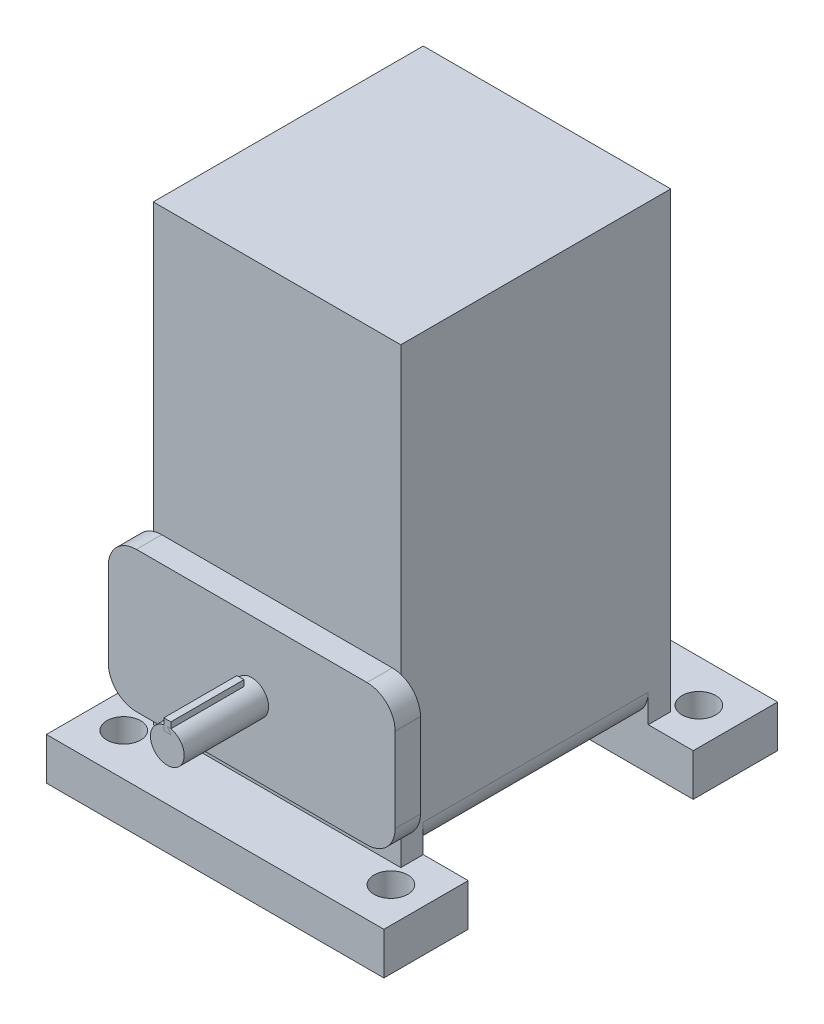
ISO-10303-21;
HEADER;
FILE_DESCRIPTION(('STEP AP214'),'2;1');
FILE_NAME('part.step','',(''),(''),'','','');
FILE_SCHEMA(('AUTOMOTIVE_DESIGN { 1 0 10303 214 1 1 1 1 }'));
ENDSEC;
DATA;
#1=APPLICATION_CONTEXT('core data for automotive mechanical design processes');
#2=APPLICATION_PROTOCOL_DEFINITION('international standard','automotive_design',2000,#1);
#3=PRODUCT_CONTEXT('',#1,'mechanical');
#4=PRODUCT('Part','Part','',(#3));
#5=PRODUCT_RELATED_PRODUCT_CATEGORY('part','',(#4));
#6=PRODUCT_DEFINITION_FORMATION('','',#4);
#7=PRODUCT_DEFINITION_CONTEXT('part definition',#1,'design');
#8=PRODUCT_DEFINITION('design','',#6,#7);
#9=PRODUCT_DEFINITION_SHAPE('','',#8);
#10=(LENGTH_UNIT() NAMED_UNIT(*) SI_UNIT(.MILLI.,.METRE.));
#11=(NAMED_UNIT(*) PLANE_ANGLE_UNIT() SI_UNIT($,.RADIAN.));
#12=(NAMED_UNIT(*) SI_UNIT($,.STERADIAN.) SOLID_ANGLE_UNIT());
#13=UNCERTAINTY_MEASURE_WITH_UNIT(LENGTH_MEASURE(1.E-05),#10,'distance_accuracy_value','');
#14=(GEOMETRIC_REPRESENTATION_CONTEXT(3) GLOBAL_UNCERTAINTY_ASSIGNED_CONTEXT((#13)) GLOBAL_UNIT_ASSIGNED_CONTEXT((#10,
#11,#12)) REPRESENTATION_CONTEXT('',''));
#15=CARTESIAN_POINT('',(0.,0.,0.));
#16=DIRECTION('',(0.,0.,1.));
#17=DIRECTION('',(1.,0.,0.));
#18=AXIS2_PLACEMENT_3D('',#15,#16,#17);
#19=CARTESIAN_POINT('',(-44.,106.,1.5));
#20=DIRECTION('',(0.,0.,1.));
#21=DIRECTION('',(1.,0.,0.));
#22=AXIS2_PLACEMENT_3D('',#19,#20,#21);
#23=PLANE('',#22);
#24=DIRECTION('',(0.,1.,0.));
#25=VECTOR('',#24,1.);
#26=CARTESIAN_POINT('',(-72.,106.,1.5));
#27=LINE('',#26,#25);
#28=CARTESIAN_POINT('',(-72.,106.,1.5));
#29=VERTEX_POINT('',#28);
#30=CARTESIAN_POINT('',(-72.,111.,1.5));
#31=VERTEX_POINT('',#30);
#32=EDGE_CURVE('E107',#29,#31,#27,.T.);
#33=ORIENTED_EDGE('',*,*,#32,.F.);
#34=DIRECTION('',(-1.,0.,0.));
#35=VECTOR('',#34,1.);
#36=CARTESIAN_POINT('',(-44.,106.,1.5));
#37=LINE('',#36,#35);
#38=CARTESIAN_POINT('',(-44.,106.,1.5));
#39=VERTEX_POINT('',#38);
#40=EDGE_CURVE('E12',#39,#29,#37,.T.);
#41=ORIENTED_EDGE('',*,*,#40,.F.);
#42=DIRECTION('',(0.,1.,0.));
#43=VECTOR('',#42,1.);
#44=CARTESIAN_POINT('',(-44.,106.,1.5));
#45=LINE('',#44,#43);
#46=CARTESIAN_POINT('',(-44.,111.,1.5));
#47=VERTEX_POINT('',#46);
#48=EDGE_CURVE('E101',#39,#47,#45,.T.);
#49=ORIENTED_EDGE('',*,*,#48,.T.);
#50=DIRECTION('',(-1.,0.,0.));
#51=VECTOR('',#50,1.);
#52=CARTESIAN_POINT('',(-44.,111.,1.5));
#53=LINE('',#52,#51);
#54=EDGE_CURVE('E46',#47,#31,#53,.T.);
#55=ORIENTED_EDGE('',*,*,#54,.T.);
#56=EDGE_LOOP('',(#33,#41,#49,#55));
#57=FACE_BOUND('',#56,.T.);
#58=ADVANCED_FACE('F43',(#57),#23,.T.);
#59=CARTESIAN_POINT('',(-44.,106.,-1.5));
#60=DIRECTION('',(0.,-1.,0.));
#61=DIRECTION('',(0.,0.,-1.));
#62=AXIS2_PLACEMENT_3D('',#59,#60,#61);
#63=PLANE('',#62);
#64=DIRECTION('',(0.,0.,1.));
#65=VECTOR('',#64,1.);
#66=CARTESIAN_POINT('',(-72.,106.,-1.5));
#67=LINE('',#66,#65);
#68=CARTESIAN_POINT('',(-72.,106.,-1.5));
#69=VERTEX_POINT('',#68);
#70=EDGE_CURVE('E103',#69,#29,#67,.T.);
#71=ORIENTED_EDGE('',*,*,#70,.F.);
#72=DIRECTION('',(-1.,0.,0.));
#73=VECTOR('',#72,1.);
#74=CARTESIAN_POINT('',(-44.,106.,-1.5));
#75=LINE('',#74,#73);
#76=CARTESIAN_POINT('',(-44.,106.,-1.5));
#77=VERTEX_POINT('',#76);
#78=EDGE_CURVE('E52',#77,#69,#75,.T.);
#79=ORIENTED_EDGE('',*,*,#78,.F.);
#80=DIRECTION('',(0.,0.,1.));
#81=VECTOR('',#80,1.);
#82=CARTESIAN_POINT('',(-44.,106.,-1.5));
#83=LINE('',#82,#81);
#84=EDGE_CURVE('E98',#77,#39,#83,.T.);
#85=ORIENTED_EDGE('',*,*,#84,.T.);
#86=ORIENTED_EDGE('',*,*,#40,.T.);
#87=EDGE_LOOP('',(#71,#79,#85,#86));
#88=FACE_BOUND('',#87,.T.);
#89=ADVANCED_FACE('F117',(#88),#63,.T.);
#90=CARTESIAN_POINT('',(-44.,106.,-1.5));
#91=DIRECTION('',(0.,0.,-1.));
#92=DIRECTION('',(-1.,0.,0.));
#93=AXIS2_PLACEMENT_3D('',#90,#91,#92);
#94=PLANE('',#93);
#95=DIRECTION('',(0.,-1.,0.));
#96=VECTOR('',#95,1.);
#97=CARTESIAN_POINT('',(-72.,106.,-1.5));
#98=LINE('',#97,#96);
#99=CARTESIAN_POINT('',(-72.,111.,-1.5));
#100=VERTEX_POINT('',#99);
#101=EDGE_CURVE('E93',#100,#69,#98,.T.);
#102=ORIENTED_EDGE('',*,*,#101,.F.);
#103=DIRECTION('',(-1.,0.,0.));
#104=VECTOR('',#103,1.);
#105=CARTESIAN_POINT('',(-44.,111.,-1.5));
#106=LINE('',#105,#104);
#107=CARTESIAN_POINT('',(-44.,111.,-1.5));
#108=VERTEX_POINT('',#107);
#109=EDGE_CURVE('E88',#108,#100,#106,.T.);
#110=ORIENTED_EDGE('',*,*,#109,.F.);
#111=DIRECTION('',(0.,-1.,0.));
#112=VECTOR('',#111,1.);
#113=CARTESIAN_POINT('',(-44.,106.,-1.5));
#114=LINE('',#113,#112);
#115=EDGE_CURVE('E91',#108,#77,#114,.T.);
#116=ORIENTED_EDGE('',*,*,#115,.T.);
#117=ORIENTED_EDGE('',*,*,#78,.T.);
#118=EDGE_LOOP('',(#102,#110,#116,#117));
#119=FACE_BOUND('',#118,.T.);
#120=ADVANCED_FACE('F90',(#119),#94,.T.);
#121=CARTESIAN_POINT('',(-44.,111.,-1.5));
#122=DIRECTION('',(0.,1.,0.));
#123=DIRECTION('',(0.,0.,1.));
#124=AXIS2_PLACEMENT_3D('',#121,#122,#123);
#125=PLANE('',#124);
#126=DIRECTION('',(0.,0.,-1.));
#127=VECTOR('',#126,1.);
#128=CARTESIAN_POINT('',(-72.,111.,-1.5));
#129=LINE('',#128,#127);
#130=EDGE_CURVE('E110',#31,#100,#129,.T.);
#131=ORIENTED_EDGE('',*,*,#130,.F.);
#132=ORIENTED_EDGE('',*,*,#54,.F.);
#133=DIRECTION('',(0.,0.,-1.));
#134=VECTOR('',#133,1.);
#135=CARTESIAN_POINT('',(-44.,111.,-1.5));
#136=LINE('',#135,#134);
#137=EDGE_CURVE('E97',#47,#108,#136,.T.);
#138=ORIENTED_EDGE('',*,*,#137,.T.);
#139=ORIENTED_EDGE('',*,*,#109,.T.);
#140=EDGE_LOOP('',(#131,#132,#138,#139));
#141=FACE_BOUND('',#140,.T.);
#142=ADVANCED_FACE('F100',(#141),#125,.T.);
#143=CARTESIAN_POINT('',(-44.,0.,0.));
#144=DIRECTION('',(1.,0.,0.));
#145=DIRECTION('',(0.,0.,-1.));
#146=AXIS2_PLACEMENT_3D('',#143,#144,#145);
#147=PLANE('',#146);
#148=ORIENTED_EDGE('',*,*,#48,.F.);
#149=ORIENTED_EDGE('',*,*,#84,.F.);
#150=ORIENTED_EDGE('',*,*,#115,.F.);
#151=ORIENTED_EDGE('',*,*,#137,.F.);
#152=EDGE_LOOP('',(#148,#149,#150,#151));
#153=FACE_BOUND('',#152,.T.);
#154=ADVANCED_FACE('F96',(#153),#147,.T.);
#155=CARTESIAN_POINT('',(-72.,0.,0.));
#156=DIRECTION('',(1.,0.,0.));
#157=DIRECTION('',(0.,0.,-1.));
#158=AXIS2_PLACEMENT_3D('',#155,#156,#157);
#159=PLANE('',#158);
#160=ORIENTED_EDGE('',*,*,#32,.T.);
#161=ORIENTED_EDGE('',*,*,#130,.T.);
#162=ORIENTED_EDGE('',*,*,#101,.T.);
#163=ORIENTED_EDGE('',*,*,#70,.T.);
#164=EDGE_LOOP('',(#160,#161,#162,#163));
#165=FACE_BOUND('',#164,.T.);
#166=ADVANCED_FACE('F116',(#165),#159,.F.);
#167=CLOSED_SHELL('',(#58,#89,#120,#142,#154,#166));
#168=MANIFOLD_SOLID_BREP('B2',#167);
#169=CARTESIAN_POINT('',(1.25,39.,61.));
#170=DIRECTION('',(1.,0.,0.));
#171=DIRECTION('',(0.,0.,-1.));
#172=AXIS2_PLACEMENT_3D('',#169,#170,#171);
#173=PLANE('',#172);
#174=DIRECTION('',(0.,1.,0.));
#175=VECTOR('',#174,1.);
#176=CARTESIAN_POINT('',(1.25,39.,87.));
#177=LINE('',#176,#175);
#178=CARTESIAN_POINT('',(1.25,39.,87.));
#179=VERTEX_POINT('',#178);
#180=CARTESIAN_POINT('',(1.25,43.,87.));
#181=VERTEX_POINT('',#180);
#182=EDGE_CURVE('E239',#179,#181,#177,.T.);
#183=ORIENTED_EDGE('',*,*,#182,.F.);
#184=DIRECTION('',(0.,0.,1.));
#185=VECTOR('',#184,1.);
#186=CARTESIAN_POINT('',(1.25,39.,61.));
#187=LINE('',#186,#185);
#188=CARTESIAN_POINT('',(1.25,39.,61.));
#189=VERTEX_POINT('',#188);
#190=EDGE_CURVE('E41',#189,#179,#187,.T.);
#191=ORIENTED_EDGE('',*,*,#190,.F.);
#192=DIRECTION('',(0.,1.,0.));
#193=VECTOR('',#192,1.);
#194=CARTESIAN_POINT('',(1.25,39.,61.));
#195=LINE('',#194,#193);
#196=CARTESIAN_POINT('',(1.25,43.,61.));
#197=VERTEX_POINT('',#196);
#198=EDGE_CURVE('E233',#189,#197,#195,.T.);
#199=ORIENTED_EDGE('',*,*,#198,.T.);
#200=DIRECTION('',(0.,0.,1.));
#201=VECTOR('',#200,1.);
#202=CARTESIAN_POINT('',(1.25,43.,61.));
#203=LINE('',#202,#201);
#204=EDGE_CURVE('E178',#197,#181,#203,.T.);
#205=ORIENTED_EDGE('',*,*,#204,.T.);
#206=EDGE_LOOP('',(#183,#191,#199,#205));
#207=FACE_BOUND('',#206,.T.);
#208=ADVANCED_FACE('F175',(#207),#173,.T.);
#209=CARTESIAN_POINT('',(-1.25,39.,61.));
#210=DIRECTION('',(0.,-1.,0.));
#211=DIRECTION('',(0.,0.,-1.));
#212=AXIS2_PLACEMENT_3D('',#209,#210,#211);
#213=PLANE('',#212);
#214=DIRECTION('',(1.,0.,0.));
#215=VECTOR('',#214,1.);
#216=CARTESIAN_POINT('',(-1.25,39.,87.));
#217=LINE('',#216,#215);
#218=CARTESIAN_POINT('',(-1.25,39.,87.));
#219=VERTEX_POINT('',#218);
#220=EDGE_CURVE('E235',#219,#179,#217,.T.);
#221=ORIENTED_EDGE('',*,*,#220,.F.);
#222=DIRECTION('',(0.,0.,1.));
#223=VECTOR('',#222,1.);
#224=CARTESIAN_POINT('',(-1.25,39.,61.));
#225=LINE('',#224,#223);
#226=CARTESIAN_POINT('',(-1.25,39.,61.));
#227=VERTEX_POINT('',#226);
#228=EDGE_CURVE('E184',#227,#219,#225,.T.);
#229=ORIENTED_EDGE('',*,*,#228,.F.);
#230=DIRECTION('',(1.,0.,0.));
#231=VECTOR('',#230,1.);
#232=CARTESIAN_POINT('',(-1.25,39.,61.));
#233=LINE('',#232,#231);
#234=EDGE_CURVE('E230',#227,#189,#233,.T.);
#235=ORIENTED_EDGE('',*,*,#234,.T.);
#236=ORIENTED_EDGE('',*,*,#190,.T.);
#237=EDGE_LOOP('',(#221,#229,#235,#236));
#238=FACE_BOUND('',#237,.T.);
#239=ADVANCED_FACE('F249',(#238),#213,.T.);
#240=CARTESIAN_POINT('',(-1.25,39.,61.));
#241=DIRECTION('',(-1.,0.,0.));
#242=DIRECTION('',(0.,0.,1.));
#243=AXIS2_PLACEMENT_3D('',#240,#241,#242);
#244=PLANE('',#243);
#245=DIRECTION('',(0.,-1.,0.));
#246=VECTOR('',#245,1.);
#247=CARTESIAN_POINT('',(-1.25,39.,87.));
#248=LINE('',#247,#246);
#249=CARTESIAN_POINT('',(-1.25,43.,87.));
#250=VERTEX_POINT('',#249);
#251=EDGE_CURVE('E225',#250,#219,#248,.T.);
#252=ORIENTED_EDGE('',*,*,#251,.F.);
#253=DIRECTION('',(0.,0.,1.));
#254=VECTOR('',#253,1.);
#255=CARTESIAN_POINT('',(-1.25,43.,61.));
#256=LINE('',#255,#254);
#257=CARTESIAN_POINT('',(-1.25,43.,61.));
#258=VERTEX_POINT('',#257);
#259=EDGE_CURVE('E220',#258,#250,#256,.T.);
#260=ORIENTED_EDGE('',*,*,#259,.F.);
#261=DIRECTION('',(0.,-1.,0.));
#262=VECTOR('',#261,1.);
#263=CARTESIAN_POINT('',(-1.25,39.,61.));
#264=LINE('',#263,#262);
#265=EDGE_CURVE('E223',#258,#227,#264,.T.);
#266=ORIENTED_EDGE('',*,*,#265,.T.);
#267=ORIENTED_EDGE('',*,*,#228,.T.);
#268=EDGE_LOOP('',(#252,#260,#266,#267));
#269=FACE_BOUND('',#268,.T.);
#270=ADVANCED_FACE('F222',(#269),#244,.T.);
#271=CARTESIAN_POINT('',(-1.25,43.,61.));
#272=DIRECTION('',(0.,1.,0.));
#273=DIRECTION('',(0.,0.,1.));
#274=AXIS2_PLACEMENT_3D('',#271,#272,#273);
#275=PLANE('',#274);
#276=DIRECTION('',(-1.,0.,0.));
#277=VECTOR('',#276,1.);
#278=CARTESIAN_POINT('',(-1.25,43.,87.));
#279=LINE('',#278,#277);
#280=EDGE_CURVE('E242',#181,#250,#279,.T.);
#281=ORIENTED_EDGE('',*,*,#280,.F.);
#282=ORIENTED_EDGE('',*,*,#204,.F.);
#283=DIRECTION('',(-1.,0.,0.));
#284=VECTOR('',#283,1.);
#285=CARTESIAN_POINT('',(-1.25,43.,61.));
#286=LINE('',#285,#284);
#287=EDGE_CURVE('E229',#197,#258,#286,.T.);
#288=ORIENTED_EDGE('',*,*,#287,.T.);
#289=ORIENTED_EDGE('',*,*,#259,.T.);
#290=EDGE_LOOP('',(#281,#282,#288,#289));
#291=FACE_BOUND('',#290,.T.);
#292=ADVANCED_FACE('F232',(#291),#275,.T.);
#293=CARTESIAN_POINT('',(0.,0.,61.));
#294=DIRECTION('',(0.,0.,-1.));
#295=DIRECTION('',(-1.,0.,0.));
#296=AXIS2_PLACEMENT_3D('',#293,#294,#295);
#297=PLANE('',#296);
#298=ORIENTED_EDGE('',*,*,#198,.F.);
#299=ORIENTED_EDGE('',*,*,#234,.F.);
#300=ORIENTED_EDGE('',*,*,#265,.F.);
#301=ORIENTED_EDGE('',*,*,#287,.F.);
#302=EDGE_LOOP('',(#298,#299,#300,#301));
#303=FACE_BOUND('',#302,.T.);
#304=ADVANCED_FACE('F228',(#303),#297,.T.);
#305=CARTESIAN_POINT('',(0.,0.,87.));
#306=DIRECTION('',(0.,0.,-1.));
#307=DIRECTION('',(-1.,0.,0.));
#308=AXIS2_PLACEMENT_3D('',#305,#306,#307);
#309=PLANE('',#308);
#310=ORIENTED_EDGE('',*,*,#182,.T.);
#311=ORIENTED_EDGE('',*,*,#280,.T.);
#312=ORIENTED_EDGE('',*,*,#251,.T.);
#313=ORIENTED_EDGE('',*,*,#220,.T.);
#314=EDGE_LOOP('',(#310,#311,#312,#313));
#315=FACE_BOUND('',#314,.T.);
#316=ADVANCED_FACE('F248',(#315),#309,.F.);
#317=CLOSED_SHELL('',(#208,#239,#270,#292,#304,#316));
#318=MANIFOLD_SOLID_BREP('B6',#317);
#319=CARTESIAN_POINT('',(0.,0.,0.));
#320=DIRECTION('',(0.,-1.,0.));
#321=DIRECTION('',(0.,0.,-1.));
#322=AXIS2_PLACEMENT_3D('',#319,#320,#321);
#323=PLANE('',#322);
#324=DIRECTION('',(1.,0.,0.));
#325=VECTOR('',#324,1.);
#326=CARTESIAN_POINT('',(0.,0.,-40.));
#327=LINE('',#326,#325);
#328=CARTESIAN_POINT('',(-34.,0.,-40.));
#329=VERTEX_POINT('',#328);
#330=CARTESIAN_POINT('',(34.,0.,-40.));
#331=VERTEX_POINT('',#330);
#332=EDGE_CURVE('E665',#329,#331,#327,.T.);
#333=ORIENTED_EDGE('',*,*,#332,.T.);
#334=DIRECTION('',(0.,0.,-1.));
#335=VECTOR('',#334,1.);
#336=CARTESIAN_POINT('',(34.,0.,40.));
#337=LINE('',#336,#335);
#338=CARTESIAN_POINT('',(34.,0.,40.));
#339=VERTEX_POINT('',#338);
#340=EDGE_CURVE('E687',#331,#339,#337,.F.);
#341=ORIENTED_EDGE('',*,*,#340,.T.);
#342=DIRECTION('',(1.,0.,0.));
#343=VECTOR('',#342,1.);
#344=CARTESIAN_POINT('',(-60.,0.,40.));
#345=LINE('',#344,#343);
#346=CARTESIAN_POINT('',(-34.,0.,40.));
#347=VERTEX_POINT('',#346);
#348=EDGE_CURVE('E533',#347,#339,#345,.T.);
#349=ORIENTED_EDGE('',*,*,#348,.F.);
#350=DIRECTION('',(0.,0.,1.));
#351=VECTOR('',#350,1.);
#352=CARTESIAN_POINT('',(-34.,0.,-40.));
#353=LINE('',#352,#351);
#354=EDGE_CURVE('E675',#347,#329,#353,.F.);
#355=ORIENTED_EDGE('',*,*,#354,.T.);
#356=EDGE_LOOP('',(#333,#341,#349,#355));
#357=FACE_BOUND('',#356,.T.);
#358=ADVANCED_FACE('F298',(#357),#323,.T.);
#359=CARTESIAN_POINT('',(-44.,161.,48.));
#360=DIRECTION('',(0.,0.,-1.));
#361=DIRECTION('',(-1.,0.,0.));
#362=AXIS2_PLACEMENT_3D('',#359,#360,#361);
#363=PLANE('',#362);
#364=DIRECTION('',(1.,0.,0.));
#365=VECTOR('',#364,1.);
#366=CARTESIAN_POINT('',(-51.,10.,48.));
#367=LINE('',#366,#365);
#368=CARTESIAN_POINT('',(-41.,10.,48.));
#369=VERTEX_POINT('',#368);
#370=CARTESIAN_POINT('',(41.,9.99999999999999,48.));
#371=VERTEX_POINT('',#370);
#372=EDGE_CURVE('E574',#369,#371,#367,.T.);
#373=ORIENTED_EDGE('',*,*,#372,.F.);
#374=CARTESIAN_POINT('',(-41.,20.,48.));
#375=DIRECTION('',(0.,0.,-1.));
#376=DIRECTION('',(-1.,0.,0.));
#377=AXIS2_PLACEMENT_3D('',#374,#375,#376);
#378=CIRCLE('',#377,10.);
#379=CARTESIAN_POINT('',(-44.,10.4606079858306,48.));
#380=VERTEX_POINT('',#379);
#381=EDGE_CURVE('E657',#369,#380,#378,.T.);
#382=ORIENTED_EDGE('',*,*,#381,.T.);
#383=DIRECTION('',(0.,-1.,0.));
#384=VECTOR('',#383,1.);
#385=CARTESIAN_POINT('',(-44.,161.,48.));
#386=LINE('',#385,#384);
#387=CARTESIAN_POINT('',(-44.,0.,48.));
#388=VERTEX_POINT('',#387);
#389=EDGE_CURVE('E605',#380,#388,#386,.T.);
#390=ORIENTED_EDGE('',*,*,#389,.T.);
#391=DIRECTION('',(1.,0.,0.));
#392=VECTOR('',#391,1.);
#393=CARTESIAN_POINT('',(-44.,0.,48.));
#394=LINE('',#393,#392);
#395=CARTESIAN_POINT('',(44.,0.,48.));
#396=VERTEX_POINT('',#395);
#397=EDGE_CURVE('E585',#388,#396,#394,.T.);
#398=ORIENTED_EDGE('',*,*,#397,.T.);
#399=DIRECTION('',(0.,-1.,0.));
#400=VECTOR('',#399,1.);
#401=CARTESIAN_POINT('',(44.,161.,48.));
#402=LINE('',#401,#400);
#403=CARTESIAN_POINT('',(44.,10.4606079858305,48.));
#404=VERTEX_POINT('',#403);
#405=EDGE_CURVE('E591',#404,#396,#402,.T.);
#406=ORIENTED_EDGE('',*,*,#405,.F.);
#407=CARTESIAN_POINT('',(41.,20.,48.));
#408=DIRECTION('',(0.,0.,-1.));
#409=DIRECTION('',(-1.,0.,0.));
#410=AXIS2_PLACEMENT_3D('',#407,#408,#409);
#411=CIRCLE('',#410,10.);
#412=EDGE_CURVE('E652',#404,#371,#411,.T.);
#413=ORIENTED_EDGE('',*,*,#412,.T.);
#414=EDGE_LOOP('',(#373,#382,#390,#398,#406,#413));
#415=FACE_BOUND('',#414,.T.);
#416=ADVANCED_FACE('F729',(#415),#363,.F.);
#417=DIRECTION('',(-1.,0.,0.));
#418=VECTOR('',#417,1.);
#419=CARTESIAN_POINT('',(-51.,60.,48.));
#420=LINE('',#419,#418);
#421=CARTESIAN_POINT('',(41.,60.,48.));
#422=VERTEX_POINT('',#421);
#423=CARTESIAN_POINT('',(-41.,60.,48.));
#424=VERTEX_POINT('',#423);
#425=EDGE_CURVE('E571',#422,#424,#420,.T.);
#426=ORIENTED_EDGE('',*,*,#425,.F.);
#427=CARTESIAN_POINT('',(41.,50.,48.));
#428=DIRECTION('',(0.,0.,-1.));
#429=DIRECTION('',(-1.,0.,0.));
#430=AXIS2_PLACEMENT_3D('',#427,#428,#429);
#431=CIRCLE('',#430,10.);
#432=CARTESIAN_POINT('',(44.,59.5393920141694,48.));
#433=VERTEX_POINT('',#432);
#434=EDGE_CURVE('E654',#422,#433,#431,.T.);
#435=ORIENTED_EDGE('',*,*,#434,.T.);
#436=CARTESIAN_POINT('',(44.,161.,48.));
#437=VERTEX_POINT('',#436);
#438=EDGE_CURVE('E603',#437,#433,#402,.T.);
#439=ORIENTED_EDGE('',*,*,#438,.F.);
#440=DIRECTION('',(1.,0.,0.));
#441=VECTOR('',#440,1.);
#442=CARTESIAN_POINT('',(-44.,161.,48.));
#443=LINE('',#442,#441);
#444=CARTESIAN_POINT('',(-44.,161.,48.));
#445=VERTEX_POINT('',#444);
#446=EDGE_CURVE('E589',#445,#437,#443,.T.);
#447=ORIENTED_EDGE('',*,*,#446,.F.);
#448=CARTESIAN_POINT('',(-44.,59.5393920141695,48.));
#449=VERTEX_POINT('',#448);
#450=EDGE_CURVE('E607',#445,#449,#386,.T.);
#451=ORIENTED_EDGE('',*,*,#450,.T.);
#452=CARTESIAN_POINT('',(-41.,50.,48.));
#453=DIRECTION('',(0.,0.,-1.));
#454=DIRECTION('',(-1.,0.,0.));
#455=AXIS2_PLACEMENT_3D('',#452,#453,#454);
#456=CIRCLE('',#455,10.);
#457=EDGE_CURVE('E660',#449,#424,#456,.T.);
#458=ORIENTED_EDGE('',*,*,#457,.T.);
#459=EDGE_LOOP('',(#426,#435,#439,#447,#451,#458));
#460=FACE_BOUND('',#459,.T.);
#461=ADVANCED_FACE('F756',(#460),#363,.F.);
#462=CARTESIAN_POINT('',(44.,161.,48.));
#463=DIRECTION('',(-1.,0.,0.));
#464=DIRECTION('',(0.,0.,1.));
#465=AXIS2_PLACEMENT_3D('',#462,#463,#464);
#466=PLANE('',#465);
#467=DIRECTION('',(0.,0.,-1.));
#468=VECTOR('',#467,1.);
#469=CARTESIAN_POINT('',(44.,10.,-40.));
#470=LINE('',#469,#468);
#471=CARTESIAN_POINT('',(44.,10.,40.));
#472=VERTEX_POINT('',#471);
#473=CARTESIAN_POINT('',(44.,10.,-40.));
#474=VERTEX_POINT('',#473);
#475=EDGE_CURVE('E682',#472,#474,#470,.T.);
#476=ORIENTED_EDGE('',*,*,#475,.T.);
#477=DIRECTION('',(0.,-1.,0.));
#478=VECTOR('',#477,1.);
#479=CARTESIAN_POINT('',(44.,161.,-40.));
#480=LINE('',#479,#478);
#481=CARTESIAN_POINT('',(44.,0.,-40.));
#482=VERTEX_POINT('',#481);
#483=EDGE_CURVE('E685',#474,#482,#480,.T.);
#484=ORIENTED_EDGE('',*,*,#483,.T.);
#485=DIRECTION('',(0.,0.,-1.));
#486=VECTOR('',#485,1.);
#487=CARTESIAN_POINT('',(44.,0.,48.));
#488=LINE('',#487,#486);
#489=CARTESIAN_POINT('',(44.,0.,-48.));
#490=VERTEX_POINT('',#489);
#491=EDGE_CURVE('E568',#482,#490,#488,.T.);
#492=ORIENTED_EDGE('',*,*,#491,.T.);
#493=DIRECTION('',(0.,-1.,0.));
#494=VECTOR('',#493,1.);
#495=CARTESIAN_POINT('',(44.,161.,-48.));
#496=LINE('',#495,#494);
#497=CARTESIAN_POINT('',(44.,161.,-48.));
#498=VERTEX_POINT('',#497);
#499=EDGE_CURVE('E575',#498,#490,#496,.T.);
#500=ORIENTED_EDGE('',*,*,#499,.F.);
#501=DIRECTION('',(0.,0.,-1.));
#502=VECTOR('',#501,1.);
#503=CARTESIAN_POINT('',(44.,161.,48.));
#504=LINE('',#503,#502);
#505=EDGE_CURVE('E581',#437,#498,#504,.T.);
#506=ORIENTED_EDGE('',*,*,#505,.F.);
#507=ORIENTED_EDGE('',*,*,#438,.T.);
#508=EDGE_CURVE('E606',#433,#404,#402,.T.);
#509=ORIENTED_EDGE('',*,*,#508,.T.);
#510=ORIENTED_EDGE('',*,*,#405,.T.);
#511=CARTESIAN_POINT('',(44.,0.,40.));
#512=VERTEX_POINT('',#511);
#513=EDGE_CURVE('E592',#396,#512,#488,.T.);
#514=ORIENTED_EDGE('',*,*,#513,.T.);
#515=DIRECTION('',(0.,1.,0.));
#516=VECTOR('',#515,1.);
#517=CARTESIAN_POINT('',(44.,161.,40.));
#518=LINE('',#517,#516);
#519=EDGE_CURVE('E312',#512,#472,#518,.T.);
#520=ORIENTED_EDGE('',*,*,#519,.T.);
#521=EDGE_LOOP('',(#476,#484,#492,#500,#506,#507,#509,#510,#514,#520));
#522=FACE_BOUND('',#521,.T.);
#523=ADVANCED_FACE('F699',(#522),#466,.F.);
#524=CARTESIAN_POINT('',(-44.,161.,-48.));
#525=DIRECTION('',(0.,0.,1.));
#526=DIRECTION('',(1.,0.,0.));
#527=AXIS2_PLACEMENT_3D('',#524,#525,#526);
#528=PLANE('',#527);
#529=DIRECTION('',(-1.,0.,0.));
#530=VECTOR('',#529,1.);
#531=CARTESIAN_POINT('',(-44.,0.,-48.));
#532=LINE('',#531,#530);
#533=CARTESIAN_POINT('',(-44.,0.,-48.));
#534=VERTEX_POINT('',#533);
#535=EDGE_CURVE('E594',#490,#534,#532,.T.);
#536=ORIENTED_EDGE('',*,*,#535,.T.);
#537=DIRECTION('',(0.,-1.,0.));
#538=VECTOR('',#537,1.);
#539=CARTESIAN_POINT('',(-44.,161.,-48.));
#540=LINE('',#539,#538);
#541=CARTESIAN_POINT('',(-44.,161.,-48.));
#542=VERTEX_POINT('',#541);
#543=EDGE_CURVE('E609',#542,#534,#540,.T.);
#544=ORIENTED_EDGE('',*,*,#543,.F.);
#545=DIRECTION('',(-1.,0.,0.));
#546=VECTOR('',#545,1.);
#547=CARTESIAN_POINT('',(-44.,161.,-48.));
#548=LINE('',#547,#546);
#549=EDGE_CURVE('E584',#498,#542,#548,.T.);
#550=ORIENTED_EDGE('',*,*,#549,.F.);
#551=ORIENTED_EDGE('',*,*,#499,.T.);
#552=EDGE_LOOP('',(#536,#544,#550,#551));
#553=FACE_BOUND('',#552,.T.);
#554=ADVANCED_FACE('F802',(#553),#528,.F.);
#555=CARTESIAN_POINT('',(-44.,161.,48.));
#556=DIRECTION('',(1.,0.,0.));
#557=DIRECTION('',(0.,0.,-1.));
#558=AXIS2_PLACEMENT_3D('',#555,#556,#557);
#559=PLANE('',#558);
#560=CARTESIAN_POINT('',(-44.,100.,0.));
#561=DIRECTION('',(1.,0.,0.));
#562=DIRECTION('',(0.,0.,-1.));
#563=AXIS2_PLACEMENT_3D('',#560,#561,#562);
#564=CIRCLE('',#563,8.5);
#565=CARTESIAN_POINT('',(-44.,100.,-8.5));
#566=VERTEX_POINT('',#565);
#567=EDGE_CURVE('E662',#566,#566,#564,.F.);
#568=ORIENTED_EDGE('',*,*,#567,.F.);
#569=EDGE_LOOP('',(#568));
#570=FACE_BOUND('',#569,.T.);
#571=DIRECTION('',(0.,0.,1.));
#572=VECTOR('',#571,1.);
#573=CARTESIAN_POINT('',(-44.,10.,40.));
#574=LINE('',#573,#572);
#575=CARTESIAN_POINT('',(-44.,10.,-40.));
#576=VERTEX_POINT('',#575);
#577=CARTESIAN_POINT('',(-44.,10.,40.));
#578=VERTEX_POINT('',#577);
#579=EDGE_CURVE('E670',#576,#578,#574,.T.);
#580=ORIENTED_EDGE('',*,*,#579,.T.);
#581=DIRECTION('',(0.,-1.,0.));
#582=VECTOR('',#581,1.);
#583=CARTESIAN_POINT('',(-44.,161.,40.));
#584=LINE('',#583,#582);
#585=CARTESIAN_POINT('',(-44.,0.,40.));
#586=VERTEX_POINT('',#585);
#587=EDGE_CURVE('E673',#578,#586,#584,.T.);
#588=ORIENTED_EDGE('',*,*,#587,.T.);
#589=DIRECTION('',(0.,0.,1.));
#590=VECTOR('',#589,1.);
#591=CARTESIAN_POINT('',(-44.,0.,48.));
#592=LINE('',#591,#590);
#593=EDGE_CURVE('E597',#586,#388,#592,.T.);
#594=ORIENTED_EDGE('',*,*,#593,.T.);
#595=ORIENTED_EDGE('',*,*,#389,.F.);
#596=EDGE_CURVE('E610',#449,#380,#386,.T.);
#597=ORIENTED_EDGE('',*,*,#596,.F.);
#598=ORIENTED_EDGE('',*,*,#450,.F.);
#599=DIRECTION('',(0.,0.,1.));
#600=VECTOR('',#599,1.);
#601=CARTESIAN_POINT('',(-44.,161.,48.));
#602=LINE('',#601,#600);
#603=EDGE_CURVE('E587',#542,#445,#602,.T.);
#604=ORIENTED_EDGE('',*,*,#603,.F.);
#605=ORIENTED_EDGE('',*,*,#543,.T.);
#606=CARTESIAN_POINT('',(-44.,0.,-40.));
#607=VERTEX_POINT('',#606);
#608=EDGE_CURVE('E598',#534,#607,#592,.T.);
#609=ORIENTED_EDGE('',*,*,#608,.T.);
#610=DIRECTION('',(0.,1.,0.));
#611=VECTOR('',#610,1.);
#612=CARTESIAN_POINT('',(-44.,161.,-40.));
#613=LINE('',#612,#611);
#614=EDGE_CURVE('E667',#607,#576,#613,.T.);
#615=ORIENTED_EDGE('',*,*,#614,.T.);
#616=EDGE_LOOP('',(#580,#588,#594,#595,#597,#598,#604,#605,#609,#615));
#617=FACE_BOUND('',#616,.T.);
#618=ADVANCED_FACE('F725',(#570,#617),#559,.F.);
#619=CARTESIAN_POINT('',(0.,161.,0.));
#620=DIRECTION('',(0.,-1.,0.));
#621=DIRECTION('',(0.,0.,-1.));
#622=AXIS2_PLACEMENT_3D('',#619,#620,#621);
#623=PLANE('',#622);
#624=ORIENTED_EDGE('',*,*,#505,.T.);
#625=ORIENTED_EDGE('',*,*,#549,.T.);
#626=ORIENTED_EDGE('',*,*,#603,.T.);
#627=ORIENTED_EDGE('',*,*,#446,.T.);
#628=EDGE_LOOP('',(#624,#625,#626,#627));
#629=FACE_BOUND('',#628,.T.);
#630=ADVANCED_FACE('F790',(#629),#623,.F.);
#631=CARTESIAN_POINT('',(0.,0.,48.));
#632=DIRECTION('',(0.,0.,1.));
#633=DIRECTION('',(1.,0.,0.));
#634=AXIS2_PLACEMENT_3D('',#631,#632,#633);
#635=PLANE('',#634);
#636=ORIENTED_EDGE('',*,*,#596,.T.);
#637=CARTESIAN_POINT('',(-41.,20.,48.));
#638=DIRECTION('',(0.,0.,1.));
#639=DIRECTION('',(1.,0.,0.));
#640=AXIS2_PLACEMENT_3D('',#637,#638,#639);
#641=CIRCLE('',#640,10.);
#642=CARTESIAN_POINT('',(-51.,20.,48.));
#643=VERTEX_POINT('',#642);
#644=EDGE_CURVE('E645',#380,#643,#641,.F.);
#645=ORIENTED_EDGE('',*,*,#644,.T.);
#646=DIRECTION('',(0.,-1.,0.));
#647=VECTOR('',#646,1.);
#648=CARTESIAN_POINT('',(-51.,60.,48.));
#649=LINE('',#648,#647);
#650=CARTESIAN_POINT('',(-51.,50.,48.));
#651=VERTEX_POINT('',#650);
#652=EDGE_CURVE('E559',#651,#643,#649,.T.);
#653=ORIENTED_EDGE('',*,*,#652,.F.);
#654=CARTESIAN_POINT('',(-41.,50.,48.));
#655=DIRECTION('',(0.,0.,1.));
#656=DIRECTION('',(1.,0.,0.));
#657=AXIS2_PLACEMENT_3D('',#654,#655,#656);
#658=CIRCLE('',#657,10.);
#659=EDGE_CURVE('E642',#651,#449,#658,.F.);
#660=ORIENTED_EDGE('',*,*,#659,.T.);
#661=EDGE_LOOP('',(#636,#645,#653,#660));
#662=FACE_BOUND('',#661,.T.);
#663=ADVANCED_FACE('F733',(#662),#635,.F.);
#664=CARTESIAN_POINT('',(51.,60.,57.));
#665=DIRECTION('',(-1.,0.,0.));
#666=DIRECTION('',(0.,-1.,0.));
#667=AXIS2_PLACEMENT_3D('',#664,#665,#666);
#668=PLANE('',#667);
#669=DIRECTION('',(0.,1.,0.));
#670=VECTOR('',#669,1.);
#671=CARTESIAN_POINT('',(51.,60.,57.));
#672=LINE('',#671,#670);
#673=CARTESIAN_POINT('',(51.,20.,57.));
#674=VERTEX_POINT('',#673);
#675=CARTESIAN_POINT('',(51.,50.,57.));
#676=VERTEX_POINT('',#675);
#677=EDGE_CURVE('E555',#674,#676,#672,.T.);
#678=ORIENTED_EDGE('',*,*,#677,.F.);
#679=DIRECTION('',(0.,0.,-1.));
#680=VECTOR('',#679,1.);
#681=CARTESIAN_POINT('',(51.,20.,57.));
#682=LINE('',#681,#680);
#683=CARTESIAN_POINT('',(51.,20.,48.));
#684=VERTEX_POINT('',#683);
#685=EDGE_CURVE('E616',#674,#684,#682,.T.);
#686=ORIENTED_EDGE('',*,*,#685,.T.);
#687=DIRECTION('',(0.,1.,0.));
#688=VECTOR('',#687,1.);
#689=CARTESIAN_POINT('',(51.,60.,48.));
#690=LINE('',#689,#688);
#691=CARTESIAN_POINT('',(51.,50.,48.));
#692=VERTEX_POINT('',#691);
#693=EDGE_CURVE('E552',#684,#692,#690,.T.);
#694=ORIENTED_EDGE('',*,*,#693,.T.);
#695=DIRECTION('',(0.,0.,-1.));
#696=VECTOR('',#695,1.);
#697=CARTESIAN_POINT('',(51.,50.,57.));
#698=LINE('',#697,#696);
#699=EDGE_CURVE('E580',#692,#676,#698,.F.);
#700=ORIENTED_EDGE('',*,*,#699,.T.);
#701=EDGE_LOOP('',(#678,#686,#694,#700));
#702=FACE_BOUND('',#701,.T.);
#703=ADVANCED_FACE('F782',(#702),#668,.F.);
#704=CARTESIAN_POINT('',(-51.,60.,57.));
#705=DIRECTION('',(0.,-1.,0.));
#706=DIRECTION('',(1.,0.,0.));
#707=AXIS2_PLACEMENT_3D('',#704,#705,#706);
#708=PLANE('',#707);
#709=DIRECTION('',(-1.,0.,0.));
#710=VECTOR('',#709,1.);
#711=CARTESIAN_POINT('',(-51.,60.,57.));
#712=LINE('',#711,#710);
#713=CARTESIAN_POINT('',(41.,60.,57.));
#714=VERTEX_POINT('',#713);
#715=CARTESIAN_POINT('',(-41.,60.,57.));
#716=VERTEX_POINT('',#715);
#717=EDGE_CURVE('E558',#714,#716,#712,.T.);
#718=ORIENTED_EDGE('',*,*,#717,.F.);
#719=DIRECTION('',(0.,0.,-1.));
#720=VECTOR('',#719,1.);
#721=CARTESIAN_POINT('',(41.,60.,57.));
#722=LINE('',#721,#720);
#723=EDGE_CURVE('E639',#714,#422,#722,.T.);
#724=ORIENTED_EDGE('',*,*,#723,.T.);
#725=ORIENTED_EDGE('',*,*,#425,.T.);
#726=DIRECTION('',(0.,0.,-1.));
#727=VECTOR('',#726,1.);
#728=CARTESIAN_POINT('',(-41.,60.,57.));
#729=LINE('',#728,#727);
#730=EDGE_CURVE('E637',#424,#716,#729,.F.);
#731=ORIENTED_EDGE('',*,*,#730,.T.);
#732=EDGE_LOOP('',(#718,#724,#725,#731));
#733=FACE_BOUND('',#732,.T.);
#734=ADVANCED_FACE('F759',(#733),#708,.F.);
#735=CARTESIAN_POINT('',(-51.,60.,57.));
#736=DIRECTION('',(1.,0.,0.));
#737=DIRECTION('',(0.,1.,0.));
#738=AXIS2_PLACEMENT_3D('',#735,#736,#737);
#739=PLANE('',#738);
#740=ORIENTED_EDGE('',*,*,#652,.T.);
#741=DIRECTION('',(0.,0.,-1.));
#742=VECTOR('',#741,1.);
#743=CARTESIAN_POINT('',(-51.,20.,57.));
#744=LINE('',#743,#742);
#745=CARTESIAN_POINT('',(-51.,20.,57.));
#746=VERTEX_POINT('',#745);
#747=EDGE_CURVE('E650',#643,#746,#744,.F.);
#748=ORIENTED_EDGE('',*,*,#747,.T.);
#749=DIRECTION('',(0.,-1.,0.));
#750=VECTOR('',#749,1.);
#751=CARTESIAN_POINT('',(-51.,60.,57.));
#752=LINE('',#751,#750);
#753=CARTESIAN_POINT('',(-51.,50.,57.));
#754=VERTEX_POINT('',#753);
#755=EDGE_CURVE('E562',#754,#746,#752,.T.);
#756=ORIENTED_EDGE('',*,*,#755,.F.);
#757=DIRECTION('',(0.,0.,-1.));
#758=VECTOR('',#757,1.);
#759=CARTESIAN_POINT('',(-51.,50.,57.));
#760=LINE('',#759,#758);
#761=EDGE_CURVE('E647',#754,#651,#760,.T.);
#762=ORIENTED_EDGE('',*,*,#761,.T.);
#763=EDGE_LOOP('',(#740,#748,#756,#762));
#764=FACE_BOUND('',#763,.T.);
#765=ADVANCED_FACE('F744',(#764),#739,.F.);
#766=CARTESIAN_POINT('',(-51.,10.,57.));
#767=DIRECTION('',(0.,1.,0.));
#768=DIRECTION('',(-1.,0.,0.));
#769=AXIS2_PLACEMENT_3D('',#766,#767,#768);
#770=PLANE('',#769);
#771=ORIENTED_EDGE('',*,*,#372,.T.);
#772=DIRECTION('',(0.,0.,-1.));
#773=VECTOR('',#772,1.);
#774=CARTESIAN_POINT('',(41.,9.99999999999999,57.));
#775=LINE('',#774,#773);
#776=CARTESIAN_POINT('',(41.,9.99999999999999,57.));
#777=VERTEX_POINT('',#776);
#778=EDGE_CURVE('E627',#371,#777,#775,.F.);
#779=ORIENTED_EDGE('',*,*,#778,.T.);
#780=DIRECTION('',(1.,0.,0.));
#781=VECTOR('',#780,1.);
#782=CARTESIAN_POINT('',(-51.,10.,57.));
#783=LINE('',#782,#781);
#784=CARTESIAN_POINT('',(-41.,10.,57.));
#785=VERTEX_POINT('',#784);
#786=EDGE_CURVE('E565',#785,#777,#783,.T.);
#787=ORIENTED_EDGE('',*,*,#786,.F.);
#788=DIRECTION('',(0.,0.,-1.));
#789=VECTOR('',#788,1.);
#790=CARTESIAN_POINT('',(-41.,10.,57.));
#791=LINE('',#790,#789);
#792=EDGE_CURVE('E624',#785,#369,#791,.T.);
#793=ORIENTED_EDGE('',*,*,#792,.T.);
#794=EDGE_LOOP('',(#771,#779,#787,#793));
#795=FACE_BOUND('',#794,.T.);
#796=ADVANCED_FACE('F779',(#795),#770,.F.);
#797=CARTESIAN_POINT('',(0.,0.,57.));
#798=DIRECTION('',(0.,0.,1.));
#799=DIRECTION('',(1.,0.,0.));
#800=AXIS2_PLACEMENT_3D('',#797,#798,#799);
#801=PLANE('',#800);
#802=CARTESIAN_POINT('',(0.,35.,57.));
#803=DIRECTION('',(0.,0.,1.));
#804=DIRECTION('',(1.,0.,0.));
#805=AXIS2_PLACEMENT_3D('',#802,#803,#804);
#806=CIRCLE('',#805,6.);
#807=CARTESIAN_POINT('',(6.,35.,57.));
#808=VERTEX_POINT('',#807);
#809=EDGE_CURVE('E548',#808,#808,#806,.T.);
#810=ORIENTED_EDGE('',*,*,#809,.F.);
#811=EDGE_LOOP('',(#810));
#812=FACE_BOUND('',#811,.T.);
#813=ORIENTED_EDGE('',*,*,#786,.T.);
#814=CARTESIAN_POINT('',(41.,20.,57.));
#815=DIRECTION('',(0.,0.,1.));
#816=DIRECTION('',(1.,0.,0.));
#817=AXIS2_PLACEMENT_3D('',#814,#815,#816);
#818=CIRCLE('',#817,10.);
#819=EDGE_CURVE('E635',#777,#674,#818,.T.);
#820=ORIENTED_EDGE('',*,*,#819,.T.);
#821=ORIENTED_EDGE('',*,*,#677,.T.);
#822=CARTESIAN_POINT('',(41.,50.,57.));
#823=DIRECTION('',(0.,0.,1.));
#824=DIRECTION('',(1.,0.,0.));
#825=AXIS2_PLACEMENT_3D('',#822,#823,#824);
#826=CIRCLE('',#825,10.);
#827=EDGE_CURVE('E633',#676,#714,#826,.T.);
#828=ORIENTED_EDGE('',*,*,#827,.T.);
#829=ORIENTED_EDGE('',*,*,#717,.T.);
#830=CARTESIAN_POINT('',(-41.,50.,57.));
#831=DIRECTION('',(0.,0.,1.));
#832=DIRECTION('',(1.,0.,0.));
#833=AXIS2_PLACEMENT_3D('',#830,#831,#832);
#834=CIRCLE('',#833,10.);
#835=EDGE_CURVE('E629',#716,#754,#834,.T.);
#836=ORIENTED_EDGE('',*,*,#835,.T.);
#837=ORIENTED_EDGE('',*,*,#755,.T.);
#838=CARTESIAN_POINT('',(-41.,20.,57.));
#839=DIRECTION('',(0.,0.,1.));
#840=DIRECTION('',(1.,0.,0.));
#841=AXIS2_PLACEMENT_3D('',#838,#839,#840);
#842=CIRCLE('',#841,10.);
#843=EDGE_CURVE('E631',#746,#785,#842,.T.);
#844=ORIENTED_EDGE('',*,*,#843,.T.);
#845=EDGE_LOOP('',(#813,#820,#821,#828,#829,#836,#837,#844));
#846=FACE_BOUND('',#845,.T.);
#847=ADVANCED_FACE('F747',(#812,#846),#801,.T.);
#848=ORIENTED_EDGE('',*,*,#693,.F.);
#849=CARTESIAN_POINT('',(41.,20.,48.));
#850=DIRECTION('',(0.,0.,1.));
#851=DIRECTION('',(1.,0.,0.));
#852=AXIS2_PLACEMENT_3D('',#849,#850,#851);
#853=CIRCLE('',#852,10.);
#854=EDGE_CURVE('E621',#684,#404,#853,.F.);
#855=ORIENTED_EDGE('',*,*,#854,.T.);
#856=ORIENTED_EDGE('',*,*,#508,.F.);
#857=CARTESIAN_POINT('',(41.,50.,48.));
#858=DIRECTION('',(0.,0.,1.));
#859=DIRECTION('',(1.,0.,0.));
#860=AXIS2_PLACEMENT_3D('',#857,#858,#859);
#861=CIRCLE('',#860,10.);
#862=EDGE_CURVE('E619',#433,#692,#861,.F.);
#863=ORIENTED_EDGE('',*,*,#862,.T.);
#864=EDGE_LOOP('',(#848,#855,#856,#863));
#865=FACE_BOUND('',#864,.T.);
#866=ADVANCED_FACE('F771',(#865),#635,.F.);
#867=CARTESIAN_POINT('',(41.,20.,57.));
#868=DIRECTION('',(0.,0.,-1.));
#869=DIRECTION('',(-1.,0.,0.));
#870=AXIS2_PLACEMENT_3D('',#867,#868,#869);
#871=CYLINDRICAL_SURFACE('',#870,10.);
#872=ORIENTED_EDGE('',*,*,#819,.F.);
#873=ORIENTED_EDGE('',*,*,#778,.F.);
#874=ORIENTED_EDGE('',*,*,#412,.F.);
#875=ORIENTED_EDGE('',*,*,#854,.F.);
#876=ORIENTED_EDGE('',*,*,#685,.F.);
#877=EDGE_LOOP('',(#872,#873,#874,#875,#876));
#878=FACE_BOUND('',#877,.T.);
#879=ADVANCED_FACE('F776',(#878),#871,.T.);
#880=CARTESIAN_POINT('',(41.,50.,57.));
#881=DIRECTION('',(0.,0.,-1.));
#882=DIRECTION('',(-1.,0.,0.));
#883=AXIS2_PLACEMENT_3D('',#880,#881,#882);
#884=CYLINDRICAL_SURFACE('',#883,10.);
#885=ORIENTED_EDGE('',*,*,#827,.F.);
#886=ORIENTED_EDGE('',*,*,#699,.F.);
#887=ORIENTED_EDGE('',*,*,#862,.F.);
#888=ORIENTED_EDGE('',*,*,#434,.F.);
#889=ORIENTED_EDGE('',*,*,#723,.F.);
#890=EDGE_LOOP('',(#885,#886,#887,#888,#889));
#891=FACE_BOUND('',#890,.T.);
#892=ADVANCED_FACE('F763',(#891),#884,.T.);
#893=CARTESIAN_POINT('',(-41.,20.,57.));
#894=DIRECTION('',(0.,0.,-1.));
#895=DIRECTION('',(-1.,0.,0.));
#896=AXIS2_PLACEMENT_3D('',#893,#894,#895);
#897=CYLINDRICAL_SURFACE('',#896,10.);
#898=ORIENTED_EDGE('',*,*,#843,.F.);
#899=ORIENTED_EDGE('',*,*,#747,.F.);
#900=ORIENTED_EDGE('',*,*,#644,.F.);
#901=ORIENTED_EDGE('',*,*,#381,.F.);
#902=ORIENTED_EDGE('',*,*,#792,.F.);
#903=EDGE_LOOP('',(#898,#899,#900,#901,#902));
#904=FACE_BOUND('',#903,.T.);
#905=ADVANCED_FACE('F740',(#904),#897,.T.);
#906=CARTESIAN_POINT('',(-41.,50.,57.));
#907=DIRECTION('',(0.,0.,-1.));
#908=DIRECTION('',(-1.,0.,0.));
#909=AXIS2_PLACEMENT_3D('',#906,#907,#908);
#910=CYLINDRICAL_SURFACE('',#909,10.);
#911=ORIENTED_EDGE('',*,*,#835,.F.);
#912=ORIENTED_EDGE('',*,*,#730,.F.);
#913=ORIENTED_EDGE('',*,*,#457,.F.);
#914=ORIENTED_EDGE('',*,*,#659,.F.);
#915=ORIENTED_EDGE('',*,*,#761,.F.);
#916=EDGE_LOOP('',(#911,#912,#913,#914,#915));
#917=FACE_BOUND('',#916,.T.);
#918=ADVANCED_FACE('F753',(#917),#910,.T.);
#919=CARTESIAN_POINT('',(0.,35.,87.));
#920=DIRECTION('',(0.,0.,-1.));
#921=DIRECTION('',(-1.,0.,0.));
#922=AXIS2_PLACEMENT_3D('',#919,#920,#921);
#923=CYLINDRICAL_SURFACE('',#922,6.);
#924=CARTESIAN_POINT('',(0.,35.,87.));
#925=DIRECTION('',(0.,0.,1.));
#926=DIRECTION('',(1.,0.,0.));
#927=AXIS2_PLACEMENT_3D('',#924,#925,#926);
#928=CIRCLE('',#927,6.);
#929=CARTESIAN_POINT('',(6.,35.,87.));
#930=VERTEX_POINT('',#929);
#931=EDGE_CURVE('E549',#930,#930,#928,.T.);
#932=ORIENTED_EDGE('',*,*,#931,.F.);
#933=EDGE_LOOP('',(#932));
#934=FACE_BOUND('',#933,.T.);
#935=ORIENTED_EDGE('',*,*,#809,.T.);
#936=EDGE_LOOP('',(#935));
#937=FACE_BOUND('',#936,.T.);
#938=ADVANCED_FACE('F816',(#934,#937),#923,.T.);
#939=CARTESIAN_POINT('',(0.,35.,87.));
#940=DIRECTION('',(0.,0.,1.));
#941=DIRECTION('',(1.,0.,0.));
#942=AXIS2_PLACEMENT_3D('',#939,#940,#941);
#943=PLANE('',#942);
#944=ORIENTED_EDGE('',*,*,#931,.T.);
#945=EDGE_LOOP('',(#944));
#946=FACE_BOUND('',#945,.T.);
#947=ADVANCED_FACE('F945',(#946),#943,.T.);
#948=CARTESIAN_POINT('',(-72.,100.,0.));
#949=DIRECTION('',(1.,0.,0.));
#950=DIRECTION('',(0.,0.,-1.));
#951=AXIS2_PLACEMENT_3D('',#948,#949,#950);
#952=CYLINDRICAL_SURFACE('',#951,8.5);
#953=CARTESIAN_POINT('',(-72.,100.,0.));
#954=DIRECTION('',(-1.,0.,0.));
#955=DIRECTION('',(0.,0.,1.));
#956=AXIS2_PLACEMENT_3D('',#953,#954,#955);
#957=CIRCLE('',#956,8.5);
#958=CARTESIAN_POINT('',(-72.,100.,8.5));
#959=VERTEX_POINT('',#958);
#960=EDGE_CURVE('E545',#959,#959,#957,.T.);
#961=ORIENTED_EDGE('',*,*,#960,.F.);
#962=EDGE_LOOP('',(#961));
#963=FACE_BOUND('',#962,.T.);
#964=ORIENTED_EDGE('',*,*,#567,.T.);
#965=EDGE_LOOP('',(#964));
#966=FACE_BOUND('',#965,.T.);
#967=ADVANCED_FACE('F955',(#963,#966),#952,.T.);
#968=CARTESIAN_POINT('',(-72.,100.,0.));
#969=DIRECTION('',(-1.,0.,0.));
#970=DIRECTION('',(0.,0.,1.));
#971=AXIS2_PLACEMENT_3D('',#968,#969,#970);
#972=PLANE('',#971);
#973=ORIENTED_EDGE('',*,*,#960,.T.);
#974=EDGE_LOOP('',(#973));
#975=FACE_BOUND('',#974,.T.);
#976=ADVANCED_FACE('F965',(#975),#972,.T.);
#977=CARTESIAN_POINT('',(0.,0.,0.));
#978=DIRECTION('',(0.,1.,0.));
#979=DIRECTION('',(0.,0.,1.));
#980=AXIS2_PLACEMENT_3D('',#977,#978,#979);
#981=PLANE('',#980);
#982=CARTESIAN_POINT('',(-47.5,0.,55.));
#983=DIRECTION('',(0.,1.,0.));
#984=DIRECTION('',(0.,0.,1.));
#985=AXIS2_PLACEMENT_3D('',#982,#983,#984);
#986=CIRCLE('',#985,6.);
#987=CARTESIAN_POINT('',(-47.5,0.,61.));
#988=VERTEX_POINT('',#987);
#989=EDGE_CURVE('E1168',#988,#988,#986,.T.);
#990=ORIENTED_EDGE('',*,*,#989,.F.);
#991=EDGE_LOOP('',(#990));
#992=FACE_BOUND('',#991,.T.);
#993=CARTESIAN_POINT('',(47.5,0.,55.));
#994=DIRECTION('',(0.,1.,0.));
#995=DIRECTION('',(0.,0.,1.));
#996=AXIS2_PLACEMENT_3D('',#993,#994,#995);
#997=CIRCLE('',#996,6.);
#998=CARTESIAN_POINT('',(47.5,0.,61.));
#999=VERTEX_POINT('',#998);
#1000=EDGE_CURVE('E1180',#999,#999,#997,.T.);
#1001=ORIENTED_EDGE('',*,*,#1000,.F.);
#1002=EDGE_LOOP('',(#1001));
#1003=FACE_BOUND('',#1002,.T.);
#1004=ORIENTED_EDGE('',*,*,#513,.F.);
#1005=ORIENTED_EDGE('',*,*,#397,.F.);
#1006=ORIENTED_EDGE('',*,*,#593,.F.);
#1007=CARTESIAN_POINT('',(-60.,0.,40.));
#1008=VERTEX_POINT('',#1007);
#1009=EDGE_CURVE('E520',#1008,#586,#345,.T.);
#1010=ORIENTED_EDGE('',*,*,#1009,.F.);
#1011=DIRECTION('',(0.,0.,-1.));
#1012=VECTOR('',#1011,1.);
#1013=CARTESIAN_POINT('',(-60.,0.,40.));
#1014=LINE('',#1013,#1012);
#1015=CARTESIAN_POINT('',(-60.,0.,70.));
#1016=VERTEX_POINT('',#1015);
#1017=EDGE_CURVE('E528',#1016,#1008,#1014,.T.);
#1018=ORIENTED_EDGE('',*,*,#1017,.F.);
#1019=DIRECTION('',(-1.,0.,0.));
#1020=VECTOR('',#1019,1.);
#1021=CARTESIAN_POINT('',(-60.,0.,70.));
#1022=LINE('',#1021,#1020);
#1023=CARTESIAN_POINT('',(60.,0.,70.));
#1024=VERTEX_POINT('',#1023);
#1025=EDGE_CURVE('E510',#1024,#1016,#1022,.T.);
#1026=ORIENTED_EDGE('',*,*,#1025,.F.);
#1027=DIRECTION('',(0.,0.,1.));
#1028=VECTOR('',#1027,1.);
#1029=CARTESIAN_POINT('',(60.,0.,40.));
#1030=LINE('',#1029,#1028);
#1031=CARTESIAN_POINT('',(60.,0.,40.));
#1032=VERTEX_POINT('',#1031);
#1033=EDGE_CURVE('E507',#1032,#1024,#1030,.T.);
#1034=ORIENTED_EDGE('',*,*,#1033,.F.);
#1035=EDGE_CURVE('E530',#512,#1032,#345,.T.);
#1036=ORIENTED_EDGE('',*,*,#1035,.F.);
#1037=EDGE_LOOP('',(#1004,#1005,#1006,#1010,#1018,#1026,#1034,#1036));
#1038=FACE_BOUND('',#1037,.T.);
#1039=ADVANCED_FACE('F707',(#992,#1003,#1038),#981,.T.);
#1040=CARTESIAN_POINT('',(60.,-15.,40.));
#1041=DIRECTION('',(-1.,0.,0.));
#1042=DIRECTION('',(0.,0.,1.));
#1043=AXIS2_PLACEMENT_3D('',#1040,#1041,#1042);
#1044=PLANE('',#1043);
#1045=ORIENTED_EDGE('',*,*,#1033,.T.);
#1046=DIRECTION('',(0.,1.,0.));
#1047=VECTOR('',#1046,1.);
#1048=CARTESIAN_POINT('',(60.,-15.,70.));
#1049=LINE('',#1048,#1047);
#1050=CARTESIAN_POINT('',(60.,-15.,70.));
#1051=VERTEX_POINT('',#1050);
#1052=EDGE_CURVE('E542',#1051,#1024,#1049,.T.);
#1053=ORIENTED_EDGE('',*,*,#1052,.F.);
#1054=DIRECTION('',(0.,0.,1.));
#1055=VECTOR('',#1054,1.);
#1056=CARTESIAN_POINT('',(60.,-15.,40.));
#1057=LINE('',#1056,#1055);
#1058=CARTESIAN_POINT('',(60.,-15.,40.));
#1059=VERTEX_POINT('',#1058);
#1060=EDGE_CURVE('E516',#1059,#1051,#1057,.T.);
#1061=ORIENTED_EDGE('',*,*,#1060,.F.);
#1062=DIRECTION('',(0.,1.,0.));
#1063=VECTOR('',#1062,1.);
#1064=CARTESIAN_POINT('',(60.,-15.,40.));
#1065=LINE('',#1064,#1063);
#1066=EDGE_CURVE('E525',#1059,#1032,#1065,.T.);
#1067=ORIENTED_EDGE('',*,*,#1066,.T.);
#1068=EDGE_LOOP('',(#1045,#1053,#1061,#1067));
#1069=FACE_BOUND('',#1068,.T.);
#1070=ADVANCED_FACE('F712',(#1069),#1044,.F.);
#1071=CARTESIAN_POINT('',(-60.,-15.,70.));
#1072=DIRECTION('',(0.,0.,-1.));
#1073=DIRECTION('',(-1.,0.,0.));
#1074=AXIS2_PLACEMENT_3D('',#1071,#1072,#1073);
#1075=PLANE('',#1074);
#1076=ORIENTED_EDGE('',*,*,#1025,.T.);
#1077=DIRECTION('',(0.,1.,0.));
#1078=VECTOR('',#1077,1.);
#1079=CARTESIAN_POINT('',(-60.,-15.,70.));
#1080=LINE('',#1079,#1078);
#1081=CARTESIAN_POINT('',(-60.,-15.,70.));
#1082=VERTEX_POINT('',#1081);
#1083=EDGE_CURVE('E539',#1082,#1016,#1080,.T.);
#1084=ORIENTED_EDGE('',*,*,#1083,.F.);
#1085=DIRECTION('',(-1.,0.,0.));
#1086=VECTOR('',#1085,1.);
#1087=CARTESIAN_POINT('',(-60.,-15.,70.));
#1088=LINE('',#1087,#1086);
#1089=EDGE_CURVE('E519',#1051,#1082,#1088,.T.);
#1090=ORIENTED_EDGE('',*,*,#1089,.F.);
#1091=ORIENTED_EDGE('',*,*,#1052,.T.);
#1092=EDGE_LOOP('',(#1076,#1084,#1090,#1091));
#1093=FACE_BOUND('',#1092,.T.);
#1094=ADVANCED_FACE('F999',(#1093),#1075,.F.);
#1095=CARTESIAN_POINT('',(-60.,-15.,40.));
#1096=DIRECTION('',(1.,0.,0.));
#1097=DIRECTION('',(0.,0.,-1.));
#1098=AXIS2_PLACEMENT_3D('',#1095,#1096,#1097);
#1099=PLANE('',#1098);
#1100=ORIENTED_EDGE('',*,*,#1017,.T.);
#1101=DIRECTION('',(0.,1.,0.));
#1102=VECTOR('',#1101,1.);
#1103=CARTESIAN_POINT('',(-60.,-15.,40.));
#1104=LINE('',#1103,#1102);
#1105=CARTESIAN_POINT('',(-60.,-15.,40.));
#1106=VERTEX_POINT('',#1105);
#1107=EDGE_CURVE('E536',#1106,#1008,#1104,.T.);
#1108=ORIENTED_EDGE('',*,*,#1107,.F.);
#1109=DIRECTION('',(0.,0.,-1.));
#1110=VECTOR('',#1109,1.);
#1111=CARTESIAN_POINT('',(-60.,-15.,40.));
#1112=LINE('',#1111,#1110);
#1113=EDGE_CURVE('E522',#1082,#1106,#1112,.T.);
#1114=ORIENTED_EDGE('',*,*,#1113,.F.);
#1115=ORIENTED_EDGE('',*,*,#1083,.T.);
#1116=EDGE_LOOP('',(#1100,#1108,#1114,#1115));
#1117=FACE_BOUND('',#1116,.T.);
#1118=ADVANCED_FACE('F1009',(#1117),#1099,.F.);
#1119=CARTESIAN_POINT('',(-60.,-15.,40.));
#1120=DIRECTION('',(0.,0.,1.));
#1121=DIRECTION('',(1.,0.,0.));
#1122=AXIS2_PLACEMENT_3D('',#1119,#1120,#1121);
#1123=PLANE('',#1122);
#1124=ORIENTED_EDGE('',*,*,#1009,.T.);
#1125=ORIENTED_EDGE('',*,*,#587,.F.);
#1126=CARTESIAN_POINT('',(-34.,10.,40.));
#1127=DIRECTION('',(0.,0.,1.));
#1128=DIRECTION('',(1.,0.,0.));
#1129=AXIS2_PLACEMENT_3D('',#1126,#1127,#1128);
#1130=CIRCLE('',#1129,10.);
#1131=EDGE_CURVE('E677',#578,#347,#1130,.T.);
#1132=ORIENTED_EDGE('',*,*,#1131,.T.);
#1133=ORIENTED_EDGE('',*,*,#348,.T.);
#1134=CARTESIAN_POINT('',(34.,10.,40.));
#1135=DIRECTION('',(0.,0.,1.));
#1136=DIRECTION('',(1.,0.,0.));
#1137=AXIS2_PLACEMENT_3D('',#1134,#1135,#1136);
#1138=CIRCLE('',#1137,10.);
#1139=EDGE_CURVE('E173',#339,#472,#1138,.T.);
#1140=ORIENTED_EDGE('',*,*,#1139,.T.);
#1141=ORIENTED_EDGE('',*,*,#519,.F.);
#1142=ORIENTED_EDGE('',*,*,#1035,.T.);
#1143=ORIENTED_EDGE('',*,*,#1066,.F.);
#1144=DIRECTION('',(1.,0.,0.));
#1145=VECTOR('',#1144,1.);
#1146=CARTESIAN_POINT('',(-60.,-15.,40.));
#1147=LINE('',#1146,#1145);
#1148=EDGE_CURVE('E524',#1106,#1059,#1147,.T.);
#1149=ORIENTED_EDGE('',*,*,#1148,.F.);
#1150=ORIENTED_EDGE('',*,*,#1107,.T.);
#1151=EDGE_LOOP('',(#1124,#1125,#1132,#1133,#1140,#1141,#1142,#1143,#1149,#1150));
#1152=FACE_BOUND('',#1151,.T.);
#1153=ADVANCED_FACE('F695',(#1152),#1123,.F.);
#1154=CARTESIAN_POINT('',(0.,-15.,0.));
#1155=DIRECTION('',(0.,1.,0.));
#1156=DIRECTION('',(0.,0.,1.));
#1157=AXIS2_PLACEMENT_3D('',#1154,#1155,#1156);
#1158=PLANE('',#1157);
#1159=CARTESIAN_POINT('',(-47.5,-15.,55.));
#1160=DIRECTION('',(0.,1.,0.));
#1161=DIRECTION('',(0.,0.,1.));
#1162=AXIS2_PLACEMENT_3D('',#1159,#1160,#1161);
#1163=CIRCLE('',#1162,6.);
#1164=CARTESIAN_POINT('',(-47.5,-15.,61.));
#1165=VERTEX_POINT('',#1164);
#1166=EDGE_CURVE('E1177',#1165,#1165,#1163,.T.);
#1167=ORIENTED_EDGE('',*,*,#1166,.T.);
#1168=EDGE_LOOP('',(#1167));
#1169=FACE_BOUND('',#1168,.T.);
#1170=CARTESIAN_POINT('',(47.5,-15.,55.));
#1171=DIRECTION('',(0.,1.,0.));
#1172=DIRECTION('',(0.,0.,1.));
#1173=AXIS2_PLACEMENT_3D('',#1170,#1171,#1172);
#1174=CIRCLE('',#1173,6.);
#1175=CARTESIAN_POINT('',(47.5,-15.,61.));
#1176=VERTEX_POINT('',#1175);
#1177=EDGE_CURVE('E841',#1176,#1176,#1174,.T.);
#1178=ORIENTED_EDGE('',*,*,#1177,.T.);
#1179=EDGE_LOOP('',(#1178));
#1180=FACE_BOUND('',#1179,.T.);
#1181=ORIENTED_EDGE('',*,*,#1060,.T.);
#1182=ORIENTED_EDGE('',*,*,#1089,.T.);
#1183=ORIENTED_EDGE('',*,*,#1113,.T.);
#1184=ORIENTED_EDGE('',*,*,#1148,.T.);
#1185=EDGE_LOOP('',(#1181,#1182,#1183,#1184));
#1186=FACE_BOUND('',#1185,.T.);
#1187=ADVANCED_FACE('F715',(#1169,#1180,#1186),#1158,.F.);
#1188=CARTESIAN_POINT('',(0.,0.,0.));
#1189=DIRECTION('',(0.,-1.,0.));
#1190=DIRECTION('',(0.,0.,-1.));
#1191=AXIS2_PLACEMENT_3D('',#1188,#1189,#1190);
#1192=PLANE('',#1191);
#1193=CARTESIAN_POINT('',(-47.,0.,-55.));
#1194=DIRECTION('',(0.,1.,0.));
#1195=DIRECTION('',(0.,0.,1.));
#1196=AXIS2_PLACEMENT_3D('',#1193,#1194,#1195);
#1197=CIRCLE('',#1196,6.);
#1198=CARTESIAN_POINT('',(-47.,0.,-49.));
#1199=VERTEX_POINT('',#1198);
#1200=EDGE_CURVE('E1171',#1199,#1199,#1197,.T.);
#1201=ORIENTED_EDGE('',*,*,#1200,.F.);
#1202=EDGE_LOOP('',(#1201));
#1203=FACE_BOUND('',#1202,.T.);
#1204=CARTESIAN_POINT('',(47.,0.,-55.));
#1205=DIRECTION('',(0.,1.,0.));
#1206=DIRECTION('',(0.,0.,1.));
#1207=AXIS2_PLACEMENT_3D('',#1204,#1205,#1206);
#1208=CIRCLE('',#1207,6.);
#1209=CARTESIAN_POINT('',(47.,0.,-49.));
#1210=VERTEX_POINT('',#1209);
#1211=EDGE_CURVE('E1164',#1210,#1210,#1208,.T.);
#1212=ORIENTED_EDGE('',*,*,#1211,.F.);
#1213=EDGE_LOOP('',(#1212));
#1214=FACE_BOUND('',#1213,.T.);
#1215=ORIENTED_EDGE('',*,*,#535,.F.);
#1216=ORIENTED_EDGE('',*,*,#491,.F.);
#1217=DIRECTION('',(-1.,0.,0.));
#1218=VECTOR('',#1217,1.);
#1219=CARTESIAN_POINT('',(-60.,0.,-40.));
#1220=LINE('',#1219,#1218);
#1221=CARTESIAN_POINT('',(60.,0.,-40.));
#1222=VERTEX_POINT('',#1221);
#1223=EDGE_CURVE('E839',#1222,#482,#1220,.T.);
#1224=ORIENTED_EDGE('',*,*,#1223,.F.);
#1225=DIRECTION('',(0.,0.,1.));
#1226=VECTOR('',#1225,1.);
#1227=CARTESIAN_POINT('',(60.,0.,-40.));
#1228=LINE('',#1227,#1226);
#1229=CARTESIAN_POINT('',(60.,0.,-70.));
#1230=VERTEX_POINT('',#1229);
#1231=EDGE_CURVE('E506',#1230,#1222,#1228,.T.);
#1232=ORIENTED_EDGE('',*,*,#1231,.F.);
#1233=DIRECTION('',(1.,0.,0.));
#1234=VECTOR('',#1233,1.);
#1235=CARTESIAN_POINT('',(-60.,0.,-70.));
#1236=LINE('',#1235,#1234);
#1237=CARTESIAN_POINT('',(-60.,0.,-70.));
#1238=VERTEX_POINT('',#1237);
#1239=EDGE_CURVE('E502',#1238,#1230,#1236,.T.);
#1240=ORIENTED_EDGE('',*,*,#1239,.F.);
#1241=DIRECTION('',(0.,0.,-1.));
#1242=VECTOR('',#1241,1.);
#1243=CARTESIAN_POINT('',(-60.,0.,-40.));
#1244=LINE('',#1243,#1242);
#1245=CARTESIAN_POINT('',(-60.,0.,-40.));
#1246=VERTEX_POINT('',#1245);
#1247=EDGE_CURVE('E838',#1246,#1238,#1244,.T.);
#1248=ORIENTED_EDGE('',*,*,#1247,.F.);
#1249=EDGE_CURVE('E835',#607,#1246,#1220,.T.);
#1250=ORIENTED_EDGE('',*,*,#1249,.F.);
#1251=ORIENTED_EDGE('',*,*,#608,.F.);
#1252=EDGE_LOOP('',(#1215,#1216,#1224,#1232,#1240,#1248,#1250,#1251));
#1253=FACE_BOUND('',#1252,.T.);
#1254=ADVANCED_FACE('F836',(#1203,#1214,#1253),#1192,.F.);
#1255=CARTESIAN_POINT('',(60.,-15.,-40.));
#1256=DIRECTION('',(-1.,0.,0.));
#1257=DIRECTION('',(0.,0.,1.));
#1258=AXIS2_PLACEMENT_3D('',#1255,#1256,#1257);
#1259=PLANE('',#1258);
#1260=ORIENTED_EDGE('',*,*,#1231,.T.);
#1261=DIRECTION('',(0.,1.,0.));
#1262=VECTOR('',#1261,1.);
#1263=CARTESIAN_POINT('',(60.,-15.,-40.));
#1264=LINE('',#1263,#1262);
#1265=CARTESIAN_POINT('',(60.,-15.,-40.));
#1266=VERTEX_POINT('',#1265);
#1267=EDGE_CURVE('E486',#1266,#1222,#1264,.T.);
#1268=ORIENTED_EDGE('',*,*,#1267,.F.);
#1269=DIRECTION('',(0.,0.,1.));
#1270=VECTOR('',#1269,1.);
#1271=CARTESIAN_POINT('',(60.,-15.,-40.));
#1272=LINE('',#1271,#1270);
#1273=CARTESIAN_POINT('',(60.,-15.,-70.));
#1274=VERTEX_POINT('',#1273);
#1275=EDGE_CURVE('E493',#1274,#1266,#1272,.T.);
#1276=ORIENTED_EDGE('',*,*,#1275,.F.);
#1277=DIRECTION('',(0.,1.,0.));
#1278=VECTOR('',#1277,1.);
#1279=CARTESIAN_POINT('',(60.,-15.,-70.));
#1280=LINE('',#1279,#1278);
#1281=EDGE_CURVE('E847',#1274,#1230,#1280,.T.);
#1282=ORIENTED_EDGE('',*,*,#1281,.T.);
#1283=EDGE_LOOP('',(#1260,#1268,#1276,#1282));
#1284=FACE_BOUND('',#1283,.T.);
#1285=ADVANCED_FACE('F504',(#1284),#1259,.F.);
#1286=CARTESIAN_POINT('',(-60.,-15.,-40.));
#1287=DIRECTION('',(0.,0.,-1.));
#1288=DIRECTION('',(-1.,0.,0.));
#1289=AXIS2_PLACEMENT_3D('',#1286,#1287,#1288);
#1290=PLANE('',#1289);
#1291=ORIENTED_EDGE('',*,*,#1223,.T.);
#1292=ORIENTED_EDGE('',*,*,#483,.F.);
#1293=CARTESIAN_POINT('',(34.,10.,-40.));
#1294=DIRECTION('',(0.,0.,-1.));
#1295=DIRECTION('',(-1.,0.,0.));
#1296=AXIS2_PLACEMENT_3D('',#1293,#1294,#1295);
#1297=CIRCLE('',#1296,10.);
#1298=EDGE_CURVE('E306',#474,#331,#1297,.T.);
#1299=ORIENTED_EDGE('',*,*,#1298,.T.);
#1300=ORIENTED_EDGE('',*,*,#332,.F.);
#1301=CARTESIAN_POINT('',(-34.,10.,-40.));
#1302=DIRECTION('',(0.,0.,-1.));
#1303=DIRECTION('',(-1.,0.,0.));
#1304=AXIS2_PLACEMENT_3D('',#1301,#1302,#1303);
#1305=CIRCLE('',#1304,10.);
#1306=EDGE_CURVE('E679',#329,#576,#1305,.T.);
#1307=ORIENTED_EDGE('',*,*,#1306,.T.);
#1308=ORIENTED_EDGE('',*,*,#614,.F.);
#1309=ORIENTED_EDGE('',*,*,#1249,.T.);
#1310=DIRECTION('',(0.,1.,0.));
#1311=VECTOR('',#1310,1.);
#1312=CARTESIAN_POINT('',(-60.,-15.,-40.));
#1313=LINE('',#1312,#1311);
#1314=CARTESIAN_POINT('',(-60.,-15.,-40.));
#1315=VERTEX_POINT('',#1314);
#1316=EDGE_CURVE('E489',#1315,#1246,#1313,.T.);
#1317=ORIENTED_EDGE('',*,*,#1316,.F.);
#1318=DIRECTION('',(-1.,0.,0.));
#1319=VECTOR('',#1318,1.);
#1320=CARTESIAN_POINT('',(-60.,-15.,-40.));
#1321=LINE('',#1320,#1319);
#1322=EDGE_CURVE('E481',#1266,#1315,#1321,.T.);
#1323=ORIENTED_EDGE('',*,*,#1322,.F.);
#1324=ORIENTED_EDGE('',*,*,#1267,.T.);
#1325=EDGE_LOOP('',(#1291,#1292,#1299,#1300,#1307,#1308,#1309,#1317,#1323,#1324));
#1326=FACE_BOUND('',#1325,.T.);
#1327=ADVANCED_FACE('F484',(#1326),#1290,.F.);
#1328=CARTESIAN_POINT('',(-60.,-15.,-40.));
#1329=DIRECTION('',(1.,0.,0.));
#1330=DIRECTION('',(0.,0.,-1.));
#1331=AXIS2_PLACEMENT_3D('',#1328,#1329,#1330);
#1332=PLANE('',#1331);
#1333=ORIENTED_EDGE('',*,*,#1247,.T.);
#1334=DIRECTION('',(0.,1.,0.));
#1335=VECTOR('',#1334,1.);
#1336=CARTESIAN_POINT('',(-60.,-15.,-70.));
#1337=LINE('',#1336,#1335);
#1338=CARTESIAN_POINT('',(-60.,-15.,-70.));
#1339=VERTEX_POINT('',#1338);
#1340=EDGE_CURVE('E512',#1339,#1238,#1337,.T.);
#1341=ORIENTED_EDGE('',*,*,#1340,.F.);
#1342=DIRECTION('',(0.,0.,-1.));
#1343=VECTOR('',#1342,1.);
#1344=CARTESIAN_POINT('',(-60.,-15.,-40.));
#1345=LINE('',#1344,#1343);
#1346=EDGE_CURVE('E492',#1315,#1339,#1345,.T.);
#1347=ORIENTED_EDGE('',*,*,#1346,.F.);
#1348=ORIENTED_EDGE('',*,*,#1316,.T.);
#1349=EDGE_LOOP('',(#1333,#1341,#1347,#1348));
#1350=FACE_BOUND('',#1349,.T.);
#1351=ADVANCED_FACE('F1037',(#1350),#1332,.F.);
#1352=CARTESIAN_POINT('',(-60.,-15.,-70.));
#1353=DIRECTION('',(0.,0.,1.));
#1354=DIRECTION('',(1.,0.,0.));
#1355=AXIS2_PLACEMENT_3D('',#1352,#1353,#1354);
#1356=PLANE('',#1355);
#1357=ORIENTED_EDGE('',*,*,#1239,.T.);
#1358=ORIENTED_EDGE('',*,*,#1281,.F.);
#1359=DIRECTION('',(1.,0.,0.));
#1360=VECTOR('',#1359,1.);
#1361=CARTESIAN_POINT('',(-60.,-15.,-70.));
#1362=LINE('',#1361,#1360);
#1363=EDGE_CURVE('E498',#1339,#1274,#1362,.T.);
#1364=ORIENTED_EDGE('',*,*,#1363,.F.);
#1365=ORIENTED_EDGE('',*,*,#1340,.T.);
#1366=EDGE_LOOP('',(#1357,#1358,#1364,#1365));
#1367=FACE_BOUND('',#1366,.T.);
#1368=ADVANCED_FACE('F851',(#1367),#1356,.F.);
#1369=CARTESIAN_POINT('',(0.,-15.,0.));
#1370=DIRECTION('',(0.,-1.,0.));
#1371=DIRECTION('',(0.,0.,-1.));
#1372=AXIS2_PLACEMENT_3D('',#1369,#1370,#1371);
#1373=PLANE('',#1372);
#1374=CARTESIAN_POINT('',(-47.,-15.,-55.));
#1375=DIRECTION('',(0.,-1.,0.));
#1376=DIRECTION('',(0.,0.,-1.));
#1377=AXIS2_PLACEMENT_3D('',#1374,#1375,#1376);
#1378=CIRCLE('',#1377,6.);
#1379=CARTESIAN_POINT('',(-47.,-15.,-61.));
#1380=VERTEX_POINT('',#1379);
#1381=EDGE_CURVE('E1166',#1380,#1380,#1378,.T.);
#1382=ORIENTED_EDGE('',*,*,#1381,.F.);
#1383=EDGE_LOOP('',(#1382));
#1384=FACE_BOUND('',#1383,.T.);
#1385=CARTESIAN_POINT('',(47.,-15.,-55.));
#1386=DIRECTION('',(0.,-1.,0.));
#1387=DIRECTION('',(0.,0.,-1.));
#1388=AXIS2_PLACEMENT_3D('',#1385,#1386,#1387);
#1389=CIRCLE('',#1388,6.);
#1390=CARTESIAN_POINT('',(47.,-15.,-61.));
#1391=VERTEX_POINT('',#1390);
#1392=EDGE_CURVE('E1161',#1391,#1391,#1389,.T.);
#1393=ORIENTED_EDGE('',*,*,#1392,.F.);
#1394=EDGE_LOOP('',(#1393));
#1395=FACE_BOUND('',#1394,.T.);
#1396=ORIENTED_EDGE('',*,*,#1275,.T.);
#1397=ORIENTED_EDGE('',*,*,#1322,.T.);
#1398=ORIENTED_EDGE('',*,*,#1346,.T.);
#1399=ORIENTED_EDGE('',*,*,#1363,.T.);
#1400=EDGE_LOOP('',(#1396,#1397,#1398,#1399));
#1401=FACE_BOUND('',#1400,.T.);
#1402=ADVANCED_FACE('F496',(#1384,#1395,#1401),#1373,.T.);
#1403=CARTESIAN_POINT('',(47.5,0.,55.));
#1404=DIRECTION('',(0.,1.,0.));
#1405=DIRECTION('',(0.,0.,1.));
#1406=AXIS2_PLACEMENT_3D('',#1403,#1404,#1405);
#1407=CYLINDRICAL_SURFACE('',#1406,6.);
#1408=ORIENTED_EDGE('',*,*,#1000,.T.);
#1409=EDGE_LOOP('',(#1408));
#1410=FACE_BOUND('',#1409,.T.);
#1411=ORIENTED_EDGE('',*,*,#1177,.F.);
#1412=EDGE_LOOP('',(#1411));
#1413=FACE_BOUND('',#1412,.T.);
#1414=ADVANCED_FACE('F1081',(#1410,#1413),#1407,.F.);
#1415=CARTESIAN_POINT('',(-47.5,0.,55.));
#1416=DIRECTION('',(0.,1.,0.));
#1417=DIRECTION('',(0.,0.,1.));
#1418=AXIS2_PLACEMENT_3D('',#1415,#1416,#1417);
#1419=CYLINDRICAL_SURFACE('',#1418,6.);
#1420=ORIENTED_EDGE('',*,*,#989,.T.);
#1421=EDGE_LOOP('',(#1420));
#1422=FACE_BOUND('',#1421,.T.);
#1423=ORIENTED_EDGE('',*,*,#1166,.F.);
#1424=EDGE_LOOP('',(#1423));
#1425=FACE_BOUND('',#1424,.T.);
#1426=ADVANCED_FACE('F1091',(#1422,#1425),#1419,.F.);
#1427=CARTESIAN_POINT('',(47.,0.,-55.));
#1428=DIRECTION('',(0.,1.,0.));
#1429=DIRECTION('',(0.,0.,1.));
#1430=AXIS2_PLACEMENT_3D('',#1427,#1428,#1429);
#1431=CYLINDRICAL_SURFACE('',#1430,6.);
#1432=ORIENTED_EDGE('',*,*,#1392,.T.);
#1433=EDGE_LOOP('',(#1432));
#1434=FACE_BOUND('',#1433,.T.);
#1435=ORIENTED_EDGE('',*,*,#1211,.T.);
#1436=EDGE_LOOP('',(#1435));
#1437=FACE_BOUND('',#1436,.T.);
#1438=ADVANCED_FACE('F825',(#1434,#1437),#1431,.F.);
#1439=CARTESIAN_POINT('',(-47.,0.,-55.));
#1440=DIRECTION('',(0.,1.,0.));
#1441=DIRECTION('',(0.,0.,1.));
#1442=AXIS2_PLACEMENT_3D('',#1439,#1440,#1441);
#1443=CYLINDRICAL_SURFACE('',#1442,6.);
#1444=ORIENTED_EDGE('',*,*,#1381,.T.);
#1445=EDGE_LOOP('',(#1444));
#1446=FACE_BOUND('',#1445,.T.);
#1447=ORIENTED_EDGE('',*,*,#1200,.T.);
#1448=EDGE_LOOP('',(#1447));
#1449=FACE_BOUND('',#1448,.T.);
#1450=ADVANCED_FACE('F819',(#1446,#1449),#1443,.F.);
#1451=CARTESIAN_POINT('',(-34.,10.,48.));
#1452=DIRECTION('',(0.,0.,-1.));
#1453=DIRECTION('',(-1.,0.,0.));
#1454=AXIS2_PLACEMENT_3D('',#1451,#1452,#1453);
#1455=CYLINDRICAL_SURFACE('',#1454,10.);
#1456=ORIENTED_EDGE('',*,*,#1306,.F.);
#1457=ORIENTED_EDGE('',*,*,#354,.F.);
#1458=ORIENTED_EDGE('',*,*,#1131,.F.);
#1459=ORIENTED_EDGE('',*,*,#579,.F.);
#1460=EDGE_LOOP('',(#1456,#1457,#1458,#1459));
#1461=FACE_BOUND('',#1460,.T.);
#1462=ADVANCED_FACE('F817',(#1461),#1455,.T.);
#1463=CARTESIAN_POINT('',(34.,10.,48.));
#1464=DIRECTION('',(0.,0.,1.));
#1465=DIRECTION('',(1.,0.,0.));
#1466=AXIS2_PLACEMENT_3D('',#1463,#1464,#1465);
#1467=CYLINDRICAL_SURFACE('',#1466,10.);
#1468=ORIENTED_EDGE('',*,*,#1139,.F.);
#1469=ORIENTED_EDGE('',*,*,#340,.F.);
#1470=ORIENTED_EDGE('',*,*,#1298,.F.);
#1471=ORIENTED_EDGE('',*,*,#475,.F.);
#1472=EDGE_LOOP('',(#1468,#1469,#1470,#1471));
#1473=FACE_BOUND('',#1472,.T.);
#1474=ADVANCED_FACE('F300',(#1473),#1467,.T.);
#1475=CLOSED_SHELL('',(#358,#416,#461,#523,#554,#618,#630,#663,#703,#734,#765,#796,#847,#866,
#879,#892,#905,#918,#938,#947,#967,#976,#1039,#1070,#1094,#1118,#1153,#1187,#1254,#1285,#1327,
#1351,#1368,#1402,#1414,#1426,#1438,#1450,#1462,#1474));
#1476=MANIFOLD_SOLID_BREP('B35',#1475);
#1477=ADVANCED_BREP_SHAPE_REPRESENTATION('',(#18,#168,#318,#1476),#14);
#1478=SHAPE_DEFINITION_REPRESENTATION(#9,#1477);
ENDSEC;
END-ISO-10303-21;
